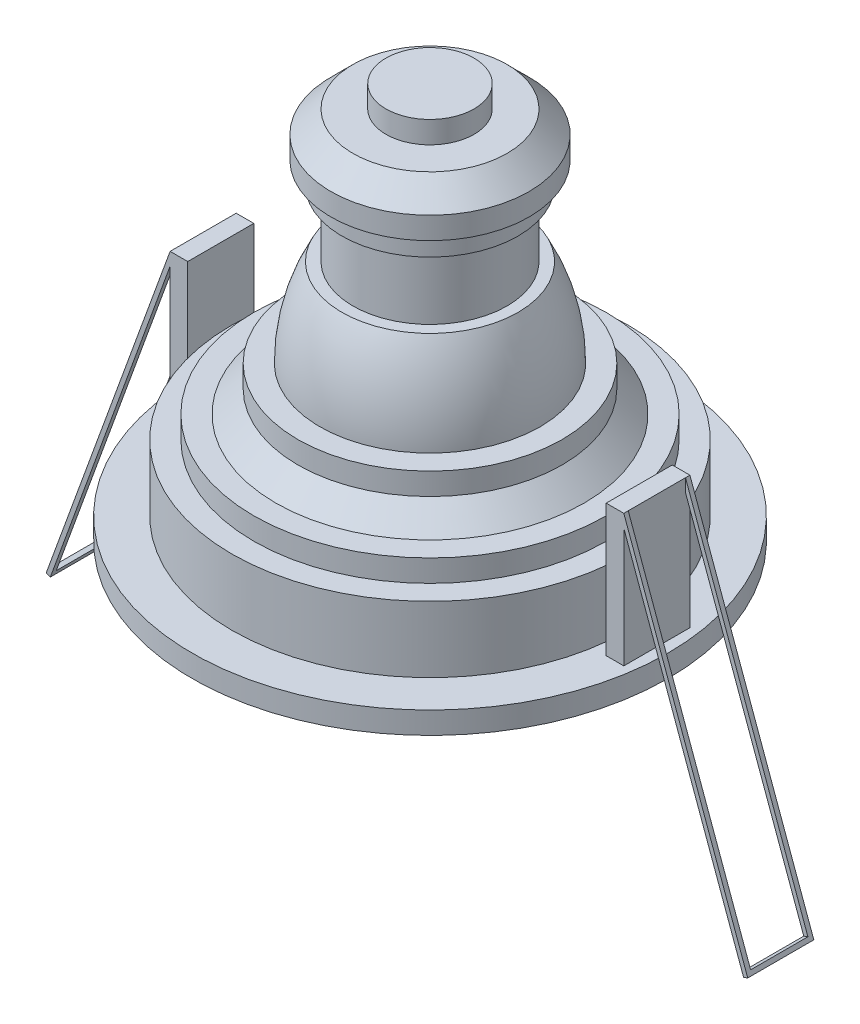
from build123d import *

# Parameters (mm, degrees)
CROQUIS2_W              = 4
CROQUIS2_H              = 15
SALIENTE_EXTRUIR1_DEPTH = 30
SALIENTE_EXTRUIR2_DEPTH = 1


with BuildPart() as part:
    # Croquis1 → Revoluci_n1 (revolve)
    with BuildSketch(Plane.XY, mode=Mode.PRIVATE) as revoluci_n1_sk:
        with BuildLine():
            Line((-54, 0), (-39, 0))
            ThreePointArc((-39, 0), (-25.499995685, 6.1999959), (-20, 20))
            Line((-20, 20), (0, 20))
            Line((0, 20), (0, 25))
            Line((0, 25), (0, 30))
            Line((0, 30), (0, 80))
            Line((0, 80), (0, 85))
            Line((0, 85), (0, 90))
            Line((0, 90), (-10, 90))
            Line((-10, 90), (-10, 85))
            Line((-10, 85), (-17.5, 85))
            Line((-17.5, 85), (-22.5, 80))
            Line((-22.5, 80), (-22.5, 75))
            Line((-22.5, 75), (-20, 75))
            Line((-20, 75), (-20, 70))
            Line((-20, 70), (-17.5, 70))
            Line((-17.5, 70), (-17.5, 55))
            Line((-17.5, 55), (-20, 55))
            ThreePointArc((-20, 55), (-23.731056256, 45.307764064), (-25, 35))
            Line((-25, 35), (-30, 35))
            Line((-30, 35), (-30, 30))
            Line((-30, 30), (-35, 25))
            Line((-35, 25), (-40, 25))
            Line((-40, 25), (-40, 20))
            Line((-40, 20), (-45, 20))
            Line((-45, 20), (-45, 5))
            Line((-45, 5), (-54, 5))
            Line((-54, 5), (-54, 0))
        make_face()
    revolve(revoluci_n1_sk.sketch.rotate(Axis((0, 20, 0), (0, 1, 0)), 180), axis=Axis((0, 20, 0), (0, 1, 0)))

    # Croquis2 → Saliente-Extruir1 (add)
    with BuildSketch(Plane(origin=(0, 5, 0), x_dir=(1, 0, 0), z_dir=(0, 1, 0))):
        with Locations((-49.5, 0)):
            Rectangle(CROQUIS2_W, CROQUIS2_H)
    saliente_extruir1 = extrude(amount=SALIENTE_EXTRUIR1_DEPTH)

    # Croquis3 → Saliente-Extruir2 (add)
    with BuildSketch(Plane(origin=(-56.72442758, 20.646003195, 0), x_dir=(0, 0, 1), z_dir=(-0.9396926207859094, 0.34202014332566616, 0))):
        Polygon((-7.5, 15.275204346), (-6.5, 15.275204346), (-6.5, -65.979713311), (6.5, -65.979713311), (6.5, 15.275204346), (7.5, 15.275204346), (7.5, -66.979713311), (-7.5, -66.979713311), align=None)
    saliente_extruir2 = extrude(amount=-SALIENTE_EXTRUIR2_DEPTH)

    # Simetr_a1: Saliente-Extruir1, Saliente-Extruir2 across plane
    add(saliente_extruir1.mirror(Plane(origin=(0, 0, 0), x_dir=(0, 0, 1), z_dir=(1, 0, 0))))
    add(saliente_extruir2.mirror(Plane(origin=(0, 0, 0), x_dir=(0, 0, 1), z_dir=(1, 0, 0))))


solid = part.part
